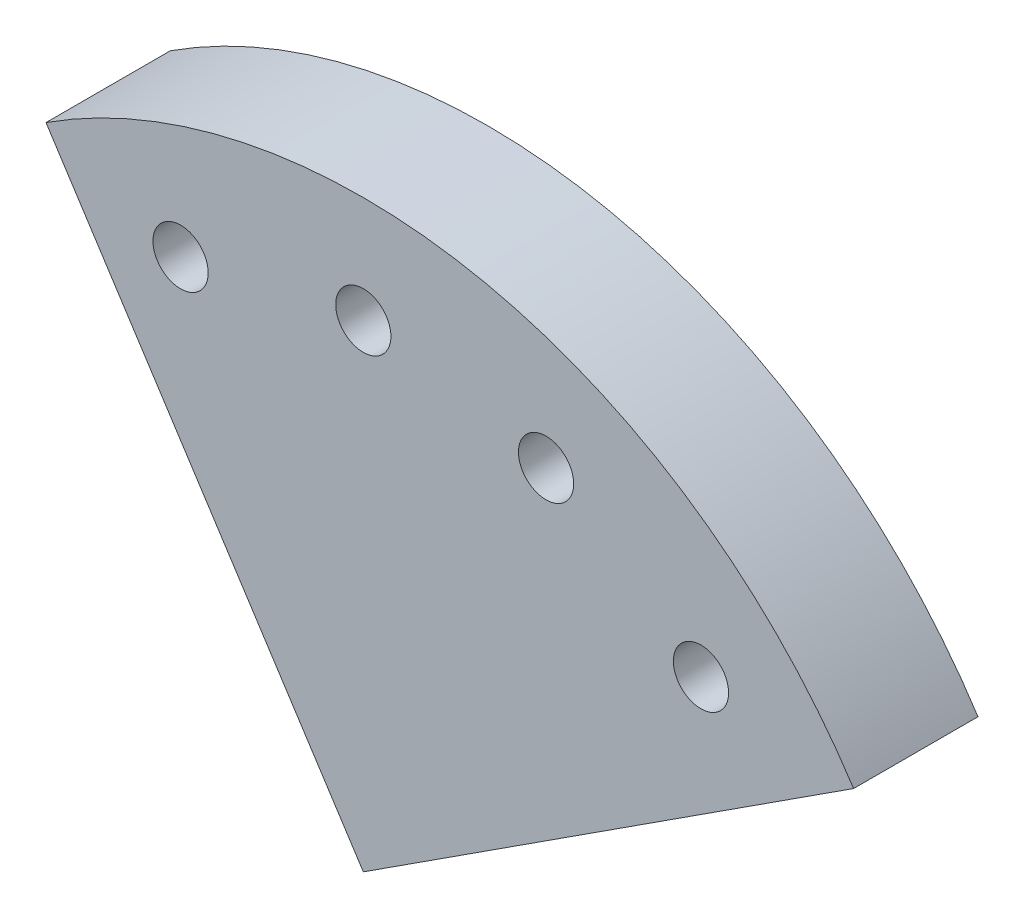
ISO-10303-21;
HEADER;
FILE_DESCRIPTION(('STEP AP214'),'2;1');
FILE_NAME('part.step','',(''),(''),'','','');
FILE_SCHEMA(('AUTOMOTIVE_DESIGN { 1 0 10303 214 1 1 1 1 }'));
ENDSEC;
DATA;
#1=APPLICATION_CONTEXT('core data for automotive mechanical design processes');
#2=APPLICATION_PROTOCOL_DEFINITION('international standard','automotive_design',2000,#1);
#3=PRODUCT_CONTEXT('',#1,'mechanical');
#4=PRODUCT('Part','Part','',(#3));
#5=PRODUCT_RELATED_PRODUCT_CATEGORY('part','',(#4));
#6=PRODUCT_DEFINITION_FORMATION('','',#4);
#7=PRODUCT_DEFINITION_CONTEXT('part definition',#1,'design');
#8=PRODUCT_DEFINITION('design','',#6,#7);
#9=PRODUCT_DEFINITION_SHAPE('','',#8);
#10=(LENGTH_UNIT() NAMED_UNIT(*) SI_UNIT(.MILLI.,.METRE.));
#11=(NAMED_UNIT(*) PLANE_ANGLE_UNIT() SI_UNIT($,.RADIAN.));
#12=(NAMED_UNIT(*) SI_UNIT($,.STERADIAN.) SOLID_ANGLE_UNIT());
#13=UNCERTAINTY_MEASURE_WITH_UNIT(LENGTH_MEASURE(1.E-05),#10,'distance_accuracy_value','');
#14=(GEOMETRIC_REPRESENTATION_CONTEXT(3) GLOBAL_UNCERTAINTY_ASSIGNED_CONTEXT((#13)) GLOBAL_UNIT_ASSIGNED_CONTEXT((#10,
#11,#12)) REPRESENTATION_CONTEXT('',''));
#15=CARTESIAN_POINT('',(0.,0.,0.));
#16=DIRECTION('',(0.,0.,1.));
#17=DIRECTION('',(1.,0.,0.));
#18=AXIS2_PLACEMENT_3D('',#15,#16,#17);
#19=CARTESIAN_POINT('',(0.,0.,5.207));
#20=DIRECTION('',(0.,0.,-1.));
#21=DIRECTION('',(-1.,0.,0.));
#22=AXIS2_PLACEMENT_3D('',#19,#20,#21);
#23=CYLINDRICAL_SURFACE('',#22,24.4475);
#24=CARTESIAN_POINT('',(0.,0.,0.));
#25=DIRECTION('',(0.,0.,1.));
#26=DIRECTION('',(1.,0.,0.));
#27=AXIS2_PLACEMENT_3D('',#24,#25,#26);
#28=CIRCLE('',#27,24.4475);
#29=CARTESIAN_POINT('',(20.5243549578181,13.2827372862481,0.));
#30=VERTEX_POINT('',#29);
#31=CARTESIAN_POINT('',(-13.2827372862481,20.5243549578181,0.));
#32=VERTEX_POINT('',#31);
#33=EDGE_CURVE('E35',#30,#32,#28,.T.);
#34=ORIENTED_EDGE('',*,*,#33,.T.);
#35=DIRECTION('',(0.,0.,-1.));
#36=VECTOR('',#35,1.);
#37=CARTESIAN_POINT('',(-13.2827372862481,20.5243549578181,5.207));
#38=LINE('',#37,#36);
#39=CARTESIAN_POINT('',(-13.2827372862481,20.5243549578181,5.207));
#40=VERTEX_POINT('',#39);
#41=EDGE_CURVE('E84',#32,#40,#38,.F.);
#42=ORIENTED_EDGE('',*,*,#41,.T.);
#43=CARTESIAN_POINT('',(0.,0.,5.207));
#44=DIRECTION('',(0.,0.,1.));
#45=DIRECTION('',(1.,0.,0.));
#46=AXIS2_PLACEMENT_3D('',#43,#44,#45);
#47=CIRCLE('',#46,24.4475);
#48=CARTESIAN_POINT('',(20.5243549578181,13.2827372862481,5.207));
#49=VERTEX_POINT('',#48);
#50=EDGE_CURVE('E11',#49,#40,#47,.T.);
#51=ORIENTED_EDGE('',*,*,#50,.F.);
#52=DIRECTION('',(0.,0.,-1.));
#53=VECTOR('',#52,1.);
#54=CARTESIAN_POINT('',(20.5243549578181,13.2827372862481,5.207));
#55=LINE('',#54,#53);
#56=EDGE_CURVE('E68',#49,#30,#55,.T.);
#57=ORIENTED_EDGE('',*,*,#56,.T.);
#58=EDGE_LOOP('',(#34,#42,#51,#57));
#59=FACE_BOUND('',#58,.T.);
#60=ADVANCED_FACE('F32',(#59),#23,.T.);
#61=CARTESIAN_POINT('',(0.,0.,5.207));
#62=DIRECTION('',(0.,0.,1.));
#63=DIRECTION('',(1.,0.,0.));
#64=AXIS2_PLACEMENT_3D('',#61,#62,#63);
#65=PLANE('',#64);
#66=DIRECTION('',(-0.543316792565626,0.839527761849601,0.));
#67=VECTOR('',#66,1.);
#68=CARTESIAN_POINT('',(-15.0514610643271,23.2573695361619,5.207));
#69=LINE('',#68,#67);
#70=CARTESIAN_POINT('',(0.,0.,5.207));
#71=VERTEX_POINT('',#70);
#72=EDGE_CURVE('E72',#71,#40,#69,.T.);
#73=ORIENTED_EDGE('',*,*,#72,.F.);
#74=DIRECTION('',(-0.839527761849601,-0.543316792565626,0.));
#75=VECTOR('',#74,1.);
#76=CARTESIAN_POINT('',(0.,0.,5.207));
#77=LINE('',#76,#75);
#78=EDGE_CURVE('E65',#49,#71,#77,.T.);
#79=ORIENTED_EDGE('',*,*,#78,.F.);
#80=ORIENTED_EDGE('',*,*,#50,.T.);
#81=EDGE_LOOP('',(#73,#79,#80));
#82=FACE_BOUND('',#81,.T.);
#83=CARTESIAN_POINT('',(-7.64976527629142,18.4681670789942,5.207));
#84=DIRECTION('',(0.,0.,1.));
#85=DIRECTION('',(0.923879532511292,0.382683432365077,0.));
#86=AXIS2_PLACEMENT_3D('',#83,#84,#85);
#87=CIRCLE('',#86,1.1557);
#88=CARTESIAN_POINT('',(-6.58203770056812,18.9104343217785,5.207));
#89=VERTEX_POINT('',#88);
#90=EDGE_CURVE('E89',#89,#89,#87,.T.);
#91=ORIENTED_EDGE('',*,*,#90,.F.);
#92=EDGE_LOOP('',(#91));
#93=FACE_BOUND('',#92,.T.);
#94=CARTESIAN_POINT('',(14.1349231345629,14.1349231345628,5.207));
#95=DIRECTION('',(0.,0.,1.));
#96=DIRECTION('',(0.707106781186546,-0.707106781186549,0.));
#97=AXIS2_PLACEMENT_3D('',#94,#95,#96);
#98=CIRCLE('',#97,1.1557);
#99=CARTESIAN_POINT('',(14.9521264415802,13.3177198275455,5.207));
#100=VERTEX_POINT('',#99);
#101=EDGE_CURVE('E95',#100,#100,#98,.T.);
#102=ORIENTED_EDGE('',*,*,#101,.F.);
#103=EDGE_LOOP('',(#102));
#104=FACE_BOUND('',#103,.T.);
#105=CARTESIAN_POINT('',(7.64976527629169,18.4681670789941,5.207));
#106=DIRECTION('',(0.,0.,1.));
#107=DIRECTION('',(0.923879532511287,-0.382683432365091,0.));
#108=AXIS2_PLACEMENT_3D('',#105,#106,#107);
#109=CIRCLE('',#108,1.1557);
#110=CARTESIAN_POINT('',(8.71749285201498,18.0258998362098,5.207));
#111=VERTEX_POINT('',#110);
#112=EDGE_CURVE('E101',#111,#111,#109,.T.);
#113=ORIENTED_EDGE('',*,*,#112,.F.);
#114=EDGE_LOOP('',(#113));
#115=FACE_BOUND('',#114,.T.);
#116=CARTESIAN_POINT('',(0.,19.9898,5.207));
#117=DIRECTION('',(0.,0.,1.));
#118=DIRECTION('',(1.,0.,0.));
#119=AXIS2_PLACEMENT_3D('',#116,#117,#118);
#120=CIRCLE('',#119,1.1557);
#121=CARTESIAN_POINT('',(1.1557,19.9898,5.207));
#122=VERTEX_POINT('',#121);
#123=EDGE_CURVE('E104',#122,#122,#120,.T.);
#124=ORIENTED_EDGE('',*,*,#123,.F.);
#125=EDGE_LOOP('',(#124));
#126=FACE_BOUND('',#125,.T.);
#127=ADVANCED_FACE('F77',(#82,#93,#104,#115,#126),#65,.T.);
#128=CARTESIAN_POINT('',(0.,0.,0.));
#129=DIRECTION('',(0.,0.,1.));
#130=DIRECTION('',(1.,0.,0.));
#131=AXIS2_PLACEMENT_3D('',#128,#129,#130);
#132=PLANE('',#131);
#133=CARTESIAN_POINT('',(-7.64976527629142,18.4681670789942,0.));
#134=DIRECTION('',(0.,0.,1.));
#135=DIRECTION('',(0.923879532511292,0.382683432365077,0.));
#136=AXIS2_PLACEMENT_3D('',#133,#134,#135);
#137=CIRCLE('',#136,1.1557);
#138=CARTESIAN_POINT('',(-6.58203770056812,18.9104343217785,0.));
#139=VERTEX_POINT('',#138);
#140=EDGE_CURVE('E86',#139,#139,#137,.T.);
#141=ORIENTED_EDGE('',*,*,#140,.T.);
#142=EDGE_LOOP('',(#141));
#143=FACE_BOUND('',#142,.T.);
#144=CARTESIAN_POINT('',(14.1349231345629,14.1349231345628,0.));
#145=DIRECTION('',(0.,0.,1.));
#146=DIRECTION('',(0.707106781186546,-0.707106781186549,0.));
#147=AXIS2_PLACEMENT_3D('',#144,#145,#146);
#148=CIRCLE('',#147,1.1557);
#149=CARTESIAN_POINT('',(14.9521264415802,13.3177198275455,0.));
#150=VERTEX_POINT('',#149);
#151=EDGE_CURVE('E92',#150,#150,#148,.T.);
#152=ORIENTED_EDGE('',*,*,#151,.T.);
#153=EDGE_LOOP('',(#152));
#154=FACE_BOUND('',#153,.T.);
#155=CARTESIAN_POINT('',(7.64976527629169,18.4681670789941,0.));
#156=DIRECTION('',(0.,0.,1.));
#157=DIRECTION('',(0.923879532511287,-0.382683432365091,0.));
#158=AXIS2_PLACEMENT_3D('',#155,#156,#157);
#159=CIRCLE('',#158,1.1557);
#160=CARTESIAN_POINT('',(8.71749285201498,18.0258998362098,0.));
#161=VERTEX_POINT('',#160);
#162=EDGE_CURVE('E98',#161,#161,#159,.T.);
#163=ORIENTED_EDGE('',*,*,#162,.T.);
#164=EDGE_LOOP('',(#163));
#165=FACE_BOUND('',#164,.T.);
#166=CARTESIAN_POINT('',(0.,19.9898,0.));
#167=DIRECTION('',(0.,0.,1.));
#168=DIRECTION('',(1.,0.,0.));
#169=AXIS2_PLACEMENT_3D('',#166,#167,#168);
#170=CIRCLE('',#169,1.1557);
#171=CARTESIAN_POINT('',(1.1557,19.9898,0.));
#172=VERTEX_POINT('',#171);
#173=EDGE_CURVE('E105',#172,#172,#170,.T.);
#174=ORIENTED_EDGE('',*,*,#173,.T.);
#175=EDGE_LOOP('',(#174));
#176=FACE_BOUND('',#175,.T.);
#177=DIRECTION('',(-0.839527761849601,-0.543316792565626,0.));
#178=VECTOR('',#177,1.);
#179=CARTESIAN_POINT('',(0.,0.,0.));
#180=LINE('',#179,#178);
#181=CARTESIAN_POINT('',(0.,0.,0.));
#182=VERTEX_POINT('',#181);
#183=EDGE_CURVE('E53',#30,#182,#180,.T.);
#184=ORIENTED_EDGE('',*,*,#183,.T.);
#185=DIRECTION('',(-0.543316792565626,0.839527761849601,0.));
#186=VECTOR('',#185,1.);
#187=CARTESIAN_POINT('',(-15.0514610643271,23.2573695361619,0.));
#188=LINE('',#187,#186);
#189=EDGE_CURVE('E46',#182,#32,#188,.T.);
#190=ORIENTED_EDGE('',*,*,#189,.T.);
#191=ORIENTED_EDGE('',*,*,#33,.F.);
#192=EDGE_LOOP('',(#184,#190,#191));
#193=FACE_BOUND('',#192,.T.);
#194=ADVANCED_FACE('F114',(#143,#154,#165,#176,#193),#132,.F.);
#195=CARTESIAN_POINT('',(0.,19.9898,0.));
#196=DIRECTION('',(0.,0.,1.));
#197=DIRECTION('',(1.,0.,0.));
#198=AXIS2_PLACEMENT_3D('',#195,#196,#197);
#199=CYLINDRICAL_SURFACE('',#198,1.1557);
#200=ORIENTED_EDGE('',*,*,#173,.F.);
#201=EDGE_LOOP('',(#200));
#202=FACE_BOUND('',#201,.T.);
#203=ORIENTED_EDGE('',*,*,#123,.T.);
#204=EDGE_LOOP('',(#203));
#205=FACE_BOUND('',#204,.T.);
#206=ADVANCED_FACE('F111',(#202,#205),#199,.F.);
#207=CARTESIAN_POINT('',(7.64976527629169,18.4681670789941,0.));
#208=DIRECTION('',(0.,0.,1.));
#209=DIRECTION('',(0.923879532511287,-0.382683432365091,0.));
#210=AXIS2_PLACEMENT_3D('',#207,#208,#209);
#211=CYLINDRICAL_SURFACE('',#210,1.1557);
#212=ORIENTED_EDGE('',*,*,#162,.F.);
#213=EDGE_LOOP('',(#212));
#214=FACE_BOUND('',#213,.T.);
#215=ORIENTED_EDGE('',*,*,#112,.T.);
#216=EDGE_LOOP('',(#215));
#217=FACE_BOUND('',#216,.T.);
#218=ADVANCED_FACE('F125',(#214,#217),#211,.F.);
#219=CARTESIAN_POINT('',(14.1349231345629,14.1349231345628,0.));
#220=DIRECTION('',(0.,0.,1.));
#221=DIRECTION('',(0.707106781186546,-0.707106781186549,0.));
#222=AXIS2_PLACEMENT_3D('',#219,#220,#221);
#223=CYLINDRICAL_SURFACE('',#222,1.1557);
#224=ORIENTED_EDGE('',*,*,#151,.F.);
#225=EDGE_LOOP('',(#224));
#226=FACE_BOUND('',#225,.T.);
#227=ORIENTED_EDGE('',*,*,#101,.T.);
#228=EDGE_LOOP('',(#227));
#229=FACE_BOUND('',#228,.T.);
#230=ADVANCED_FACE('F129',(#226,#229),#223,.F.);
#231=CARTESIAN_POINT('',(-7.64976527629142,18.4681670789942,0.));
#232=DIRECTION('',(0.,0.,1.));
#233=DIRECTION('',(0.923879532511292,0.382683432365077,0.));
#234=AXIS2_PLACEMENT_3D('',#231,#232,#233);
#235=CYLINDRICAL_SURFACE('',#234,1.1557);
#236=ORIENTED_EDGE('',*,*,#140,.F.);
#237=EDGE_LOOP('',(#236));
#238=FACE_BOUND('',#237,.T.);
#239=ORIENTED_EDGE('',*,*,#90,.T.);
#240=EDGE_LOOP('',(#239));
#241=FACE_BOUND('',#240,.T.);
#242=ADVANCED_FACE('F133',(#238,#241),#235,.F.);
#243=CARTESIAN_POINT('',(-15.0514610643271,23.2573695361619,0.));
#244=DIRECTION('',(0.839527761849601,0.543316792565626,0.));
#245=DIRECTION('',(-0.543316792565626,0.839527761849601,0.));
#246=AXIS2_PLACEMENT_3D('',#243,#244,#245);
#247=PLANE('',#246);
#248=ORIENTED_EDGE('',*,*,#189,.F.);
#249=DIRECTION('',(0.,0.,1.));
#250=VECTOR('',#249,1.);
#251=CARTESIAN_POINT('',(0.,0.,0.));
#252=LINE('',#251,#250);
#253=EDGE_CURVE('E67',#182,#71,#252,.T.);
#254=ORIENTED_EDGE('',*,*,#253,.T.);
#255=ORIENTED_EDGE('',*,*,#72,.T.);
#256=ORIENTED_EDGE('',*,*,#41,.F.);
#257=EDGE_LOOP('',(#248,#254,#255,#256));
#258=FACE_BOUND('',#257,.T.);
#259=ADVANCED_FACE('F74',(#258),#247,.F.);
#260=CARTESIAN_POINT('',(0.,0.,0.));
#261=DIRECTION('',(-0.543316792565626,0.839527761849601,0.));
#262=DIRECTION('',(-0.839527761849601,-0.543316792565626,0.));
#263=AXIS2_PLACEMENT_3D('',#260,#261,#262);
#264=PLANE('',#263);
#265=ORIENTED_EDGE('',*,*,#78,.T.);
#266=ORIENTED_EDGE('',*,*,#253,.F.);
#267=ORIENTED_EDGE('',*,*,#183,.F.);
#268=ORIENTED_EDGE('',*,*,#56,.F.);
#269=EDGE_LOOP('',(#265,#266,#267,#268));
#270=FACE_BOUND('',#269,.T.);
#271=ADVANCED_FACE('F66',(#270),#264,.F.);
#272=CLOSED_SHELL('',(#60,#127,#194,#206,#218,#230,#242,#259,#271));
#273=MANIFOLD_SOLID_BREP('B2',#272);
#274=ADVANCED_BREP_SHAPE_REPRESENTATION('',(#18,#273),#14);
#275=SHAPE_DEFINITION_REPRESENTATION(#9,#274);
ENDSEC;
END-ISO-10303-21;
